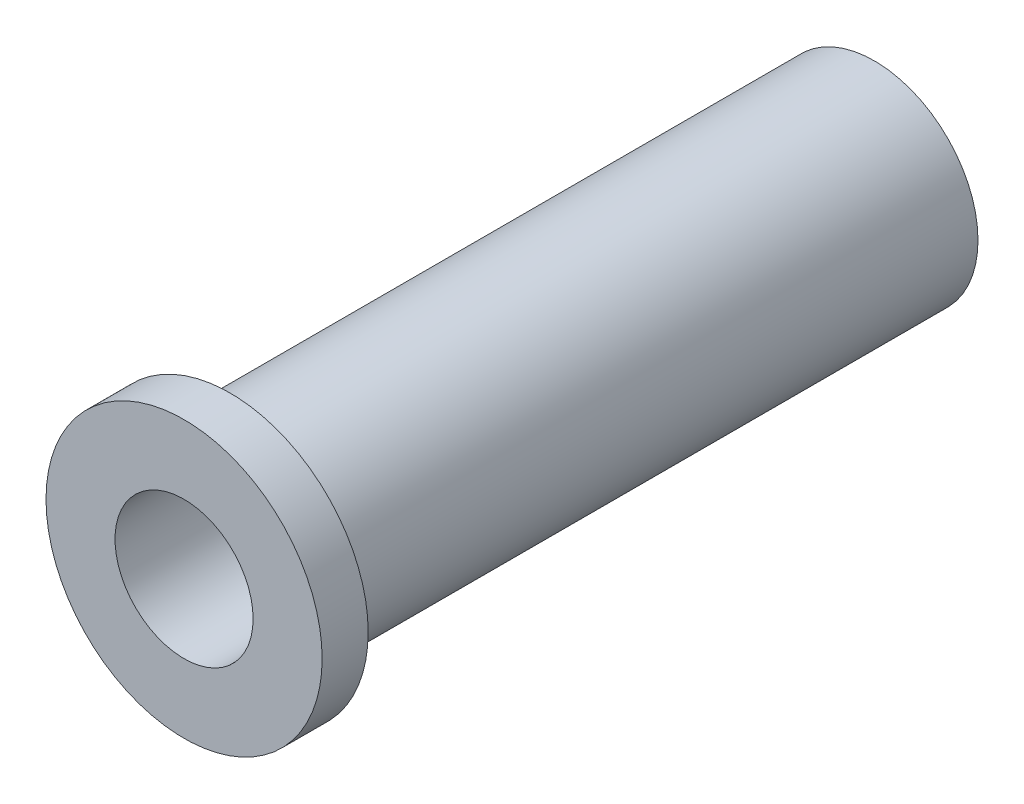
ISO-10303-21;
HEADER;
FILE_DESCRIPTION(('STEP AP214'),'2;1');
FILE_NAME('part.step','',(''),(''),'','','');
FILE_SCHEMA(('AUTOMOTIVE_DESIGN { 1 0 10303 214 1 1 1 1 }'));
ENDSEC;
DATA;
#1=APPLICATION_CONTEXT('core data for automotive mechanical design processes');
#2=APPLICATION_PROTOCOL_DEFINITION('international standard','automotive_design',2000,#1);
#3=PRODUCT_CONTEXT('',#1,'mechanical');
#4=PRODUCT('Part','Part','',(#3));
#5=PRODUCT_RELATED_PRODUCT_CATEGORY('part','',(#4));
#6=PRODUCT_DEFINITION_FORMATION('','',#4);
#7=PRODUCT_DEFINITION_CONTEXT('part definition',#1,'design');
#8=PRODUCT_DEFINITION('design','',#6,#7);
#9=PRODUCT_DEFINITION_SHAPE('','',#8);
#10=(LENGTH_UNIT() NAMED_UNIT(*) SI_UNIT(.MILLI.,.METRE.));
#11=(NAMED_UNIT(*) PLANE_ANGLE_UNIT() SI_UNIT($,.RADIAN.));
#12=(NAMED_UNIT(*) SI_UNIT($,.STERADIAN.) SOLID_ANGLE_UNIT());
#13=UNCERTAINTY_MEASURE_WITH_UNIT(LENGTH_MEASURE(1.E-05),#10,'distance_accuracy_value','');
#14=(GEOMETRIC_REPRESENTATION_CONTEXT(3) GLOBAL_UNCERTAINTY_ASSIGNED_CONTEXT((#13)) GLOBAL_UNIT_ASSIGNED_CONTEXT((#10,
#11,#12)) REPRESENTATION_CONTEXT('',''));
#15=CARTESIAN_POINT('',(0.,0.,0.));
#16=DIRECTION('',(0.,0.,1.));
#17=DIRECTION('',(1.,0.,0.));
#18=AXIS2_PLACEMENT_3D('',#15,#16,#17);
#19=CARTESIAN_POINT('',(0.,0.,28.));
#20=DIRECTION('',(0.,0.,-1.));
#21=DIRECTION('',(-1.,0.,0.));
#22=AXIS2_PLACEMENT_3D('',#19,#20,#21);
#23=CYLINDRICAL_SURFACE('',#22,4.5);
#24=CARTESIAN_POINT('',(0.,0.,28.));
#25=DIRECTION('',(0.,0.,1.));
#26=DIRECTION('',(1.,0.,0.));
#27=AXIS2_PLACEMENT_3D('',#24,#25,#26);
#28=CIRCLE('',#27,4.5);
#29=CARTESIAN_POINT('',(4.5,0.,28.));
#30=VERTEX_POINT('',#29);
#31=EDGE_CURVE('E10',#30,#30,#28,.T.);
#32=ORIENTED_EDGE('',*,*,#31,.F.);
#33=EDGE_LOOP('',(#32));
#34=FACE_BOUND('',#33,.T.);
#35=CARTESIAN_POINT('',(0.,0.,0.));
#36=DIRECTION('',(0.,0.,1.));
#37=DIRECTION('',(1.,0.,0.));
#38=AXIS2_PLACEMENT_3D('',#35,#36,#37);
#39=CIRCLE('',#38,4.5);
#40=CARTESIAN_POINT('',(4.5,0.,0.));
#41=VERTEX_POINT('',#40);
#42=EDGE_CURVE('E30',#41,#41,#39,.T.);
#43=ORIENTED_EDGE('',*,*,#42,.T.);
#44=EDGE_LOOP('',(#43));
#45=FACE_BOUND('',#44,.T.);
#46=ADVANCED_FACE('F24',(#34,#45),#23,.T.);
#47=CARTESIAN_POINT('',(0.,0.,0.));
#48=DIRECTION('',(0.,0.,1.));
#49=DIRECTION('',(1.,0.,0.));
#50=AXIS2_PLACEMENT_3D('',#47,#48,#49);
#51=PLANE('',#50);
#52=CARTESIAN_POINT('',(0.,0.,0.));
#53=DIRECTION('',(0.,0.,1.));
#54=DIRECTION('',(1.,0.,0.));
#55=AXIS2_PLACEMENT_3D('',#52,#53,#54);
#56=CIRCLE('',#55,3.);
#57=CARTESIAN_POINT('',(3.,0.,0.));
#58=VERTEX_POINT('',#57);
#59=EDGE_CURVE('E43',#58,#58,#56,.T.);
#60=ORIENTED_EDGE('',*,*,#59,.T.);
#61=EDGE_LOOP('',(#60));
#62=FACE_BOUND('',#61,.T.);
#63=ORIENTED_EDGE('',*,*,#42,.F.);
#64=EDGE_LOOP('',(#63));
#65=FACE_BOUND('',#64,.T.);
#66=ADVANCED_FACE('F66',(#62,#65),#51,.F.);
#67=CARTESIAN_POINT('',(0.,0.,28.));
#68=DIRECTION('',(0.,0.,1.));
#69=DIRECTION('',(1.,0.,0.));
#70=AXIS2_PLACEMENT_3D('',#67,#68,#69);
#71=PLANE('',#70);
#72=CARTESIAN_POINT('',(0.,0.,28.));
#73=DIRECTION('',(0.,0.,1.));
#74=DIRECTION('',(1.,0.,0.));
#75=AXIS2_PLACEMENT_3D('',#72,#73,#74);
#76=CIRCLE('',#75,6.);
#77=CARTESIAN_POINT('',(6.,0.,28.));
#78=VERTEX_POINT('',#77);
#79=EDGE_CURVE('E38',#78,#78,#76,.T.);
#80=ORIENTED_EDGE('',*,*,#79,.F.);
#81=EDGE_LOOP('',(#80));
#82=FACE_BOUND('',#81,.T.);
#83=ORIENTED_EDGE('',*,*,#31,.T.);
#84=EDGE_LOOP('',(#83));
#85=FACE_BOUND('',#84,.T.);
#86=ADVANCED_FACE('F61',(#82,#85),#71,.F.);
#87=CARTESIAN_POINT('',(0.,0.,30.));
#88=DIRECTION('',(0.,0.,-1.));
#89=DIRECTION('',(-1.,0.,0.));
#90=AXIS2_PLACEMENT_3D('',#87,#88,#89);
#91=CYLINDRICAL_SURFACE('',#90,6.);
#92=CARTESIAN_POINT('',(0.,0.,30.));
#93=DIRECTION('',(0.,0.,1.));
#94=DIRECTION('',(1.,0.,0.));
#95=AXIS2_PLACEMENT_3D('',#92,#93,#94);
#96=CIRCLE('',#95,6.);
#97=CARTESIAN_POINT('',(6.,0.,30.));
#98=VERTEX_POINT('',#97);
#99=EDGE_CURVE('E34',#98,#98,#96,.T.);
#100=ORIENTED_EDGE('',*,*,#99,.F.);
#101=EDGE_LOOP('',(#100));
#102=FACE_BOUND('',#101,.T.);
#103=ORIENTED_EDGE('',*,*,#79,.T.);
#104=EDGE_LOOP('',(#103));
#105=FACE_BOUND('',#104,.T.);
#106=ADVANCED_FACE('F55',(#102,#105),#91,.T.);
#107=CARTESIAN_POINT('',(0.,0.,30.));
#108=DIRECTION('',(0.,0.,1.));
#109=DIRECTION('',(1.,0.,0.));
#110=AXIS2_PLACEMENT_3D('',#107,#108,#109);
#111=PLANE('',#110);
#112=CARTESIAN_POINT('',(0.,0.,30.));
#113=DIRECTION('',(0.,0.,1.));
#114=DIRECTION('',(1.,0.,0.));
#115=AXIS2_PLACEMENT_3D('',#112,#113,#114);
#116=CIRCLE('',#115,3.);
#117=CARTESIAN_POINT('',(3.,0.,30.));
#118=VERTEX_POINT('',#117);
#119=EDGE_CURVE('E46',#118,#118,#116,.T.);
#120=ORIENTED_EDGE('',*,*,#119,.F.);
#121=EDGE_LOOP('',(#120));
#122=FACE_BOUND('',#121,.T.);
#123=ORIENTED_EDGE('',*,*,#99,.T.);
#124=EDGE_LOOP('',(#123));
#125=FACE_BOUND('',#124,.T.);
#126=ADVANCED_FACE('F52',(#122,#125),#111,.T.);
#127=CARTESIAN_POINT('',(0.,0.,0.));
#128=DIRECTION('',(0.,0.,1.));
#129=DIRECTION('',(1.,0.,0.));
#130=AXIS2_PLACEMENT_3D('',#127,#128,#129);
#131=CYLINDRICAL_SURFACE('',#130,3.);
#132=ORIENTED_EDGE('',*,*,#59,.F.);
#133=EDGE_LOOP('',(#132));
#134=FACE_BOUND('',#133,.T.);
#135=ORIENTED_EDGE('',*,*,#119,.T.);
#136=EDGE_LOOP('',(#135));
#137=FACE_BOUND('',#136,.T.);
#138=ADVANCED_FACE('F50',(#134,#137),#131,.F.);
#139=CLOSED_SHELL('',(#46,#66,#86,#106,#126,#138));
#140=MANIFOLD_SOLID_BREP('B2',#139);
#141=ADVANCED_BREP_SHAPE_REPRESENTATION('',(#18,#140),#14);
#142=SHAPE_DEFINITION_REPRESENTATION(#9,#141);
ENDSEC;
END-ISO-10303-21;
